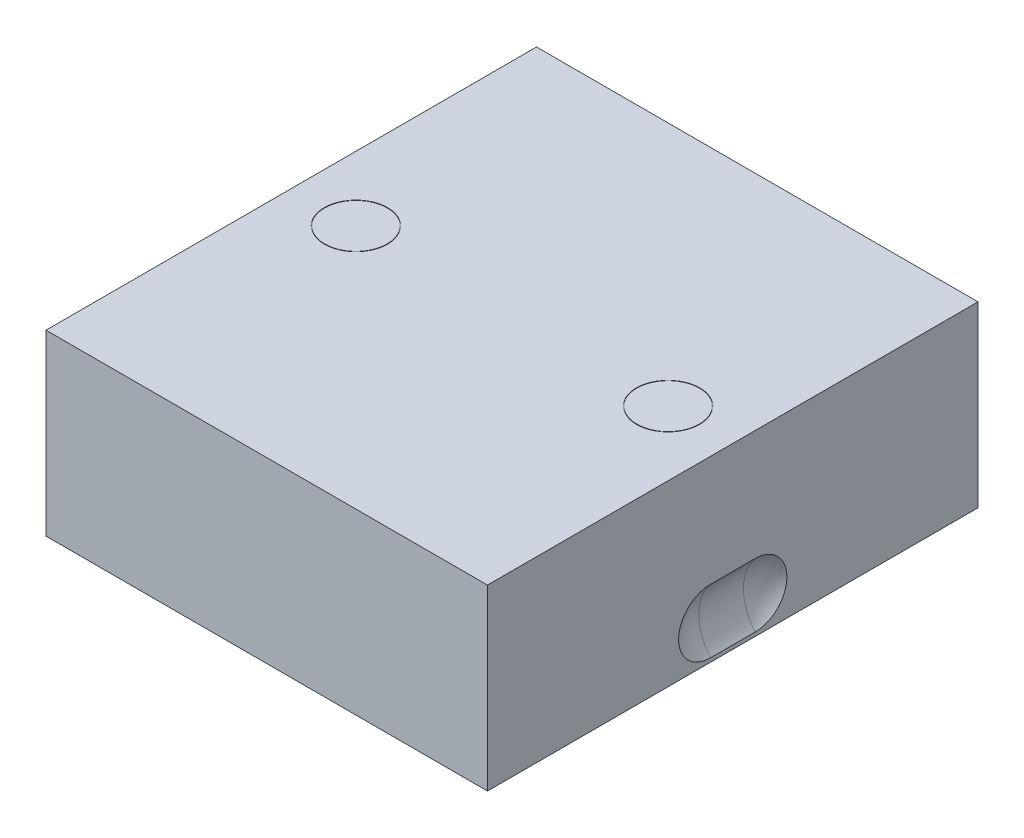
ISO-10303-21;
HEADER;
FILE_DESCRIPTION(('STEP AP214'),'2;1');
FILE_NAME('part.step','',(''),(''),'','','');
FILE_SCHEMA(('AUTOMOTIVE_DESIGN { 1 0 10303 214 1 1 1 1 }'));
ENDSEC;
DATA;
#1=APPLICATION_CONTEXT('core data for automotive mechanical design processes');
#2=APPLICATION_PROTOCOL_DEFINITION('international standard','automotive_design',2000,#1);
#3=PRODUCT_CONTEXT('',#1,'mechanical');
#4=PRODUCT('Part','Part','',(#3));
#5=PRODUCT_RELATED_PRODUCT_CATEGORY('part','',(#4));
#6=PRODUCT_DEFINITION_FORMATION('','',#4);
#7=PRODUCT_DEFINITION_CONTEXT('part definition',#1,'design');
#8=PRODUCT_DEFINITION('design','',#6,#7);
#9=PRODUCT_DEFINITION_SHAPE('','',#8);
#10=(LENGTH_UNIT() NAMED_UNIT(*) SI_UNIT(.MILLI.,.METRE.));
#11=(NAMED_UNIT(*) PLANE_ANGLE_UNIT() SI_UNIT($,.RADIAN.));
#12=(NAMED_UNIT(*) SI_UNIT($,.STERADIAN.) SOLID_ANGLE_UNIT());
#13=UNCERTAINTY_MEASURE_WITH_UNIT(LENGTH_MEASURE(1.E-05),#10,'distance_accuracy_value','');
#14=(GEOMETRIC_REPRESENTATION_CONTEXT(3) GLOBAL_UNCERTAINTY_ASSIGNED_CONTEXT((#13)) GLOBAL_UNIT_ASSIGNED_CONTEXT((#10,
#11,#12)) REPRESENTATION_CONTEXT('',''));
#15=CARTESIAN_POINT('',(0.,0.,0.));
#16=DIRECTION('',(0.,0.,1.));
#17=DIRECTION('',(1.,0.,0.));
#18=AXIS2_PLACEMENT_3D('',#15,#16,#17);
#19=CARTESIAN_POINT('',(35.,91.5,0.));
#20=DIRECTION('',(0.,1.,0.));
#21=DIRECTION('',(0.,0.,1.));
#22=AXIS2_PLACEMENT_3D('',#19,#20,#21);
#23=PLANE('',#22);
#24=CARTESIAN_POINT('',(35.,91.5,0.));
#25=DIRECTION('',(0.,-1.,0.));
#26=DIRECTION('',(0.,0.,-1.));
#27=AXIS2_PLACEMENT_3D('',#24,#25,#26);
#28=CIRCLE('',#27,7.);
#29=CARTESIAN_POINT('',(35.,91.5,-7.));
#30=VERTEX_POINT('',#29);
#31=EDGE_CURVE('E9',#30,#30,#28,.F.);
#32=ORIENTED_EDGE('',*,*,#31,.F.);
#33=EDGE_LOOP('',(#32));
#34=FACE_BOUND('',#33,.T.);
#35=ADVANCED_FACE('F14',(#34),#23,.F.);
#36=CARTESIAN_POINT('',(35.,95.,0.));
#37=DIRECTION('',(0.,1.,0.));
#38=DIRECTION('',(0.,0.,1.));
#39=AXIS2_PLACEMENT_3D('',#36,#37,#38);
#40=PLANE('',#39);
#41=CARTESIAN_POINT('',(35.,95.,0.));
#42=DIRECTION('',(0.,1.,0.));
#43=DIRECTION('',(0.,0.,1.));
#44=AXIS2_PLACEMENT_3D('',#41,#42,#43);
#45=CIRCLE('',#44,7.1);
#46=CARTESIAN_POINT('',(35.,95.,7.1));
#47=VERTEX_POINT('',#46);
#48=EDGE_CURVE('E344',#47,#47,#45,.T.);
#49=ORIENTED_EDGE('',*,*,#48,.F.);
#50=EDGE_LOOP('',(#49));
#51=FACE_BOUND('',#50,.T.);
#52=CARTESIAN_POINT('',(-35.,95.,0.));
#53=DIRECTION('',(0.,1.,0.));
#54=DIRECTION('',(0.,0.,1.));
#55=AXIS2_PLACEMENT_3D('',#52,#53,#54);
#56=CIRCLE('',#55,7.1);
#57=CARTESIAN_POINT('',(-35.,95.,7.1));
#58=VERTEX_POINT('',#57);
#59=EDGE_CURVE('E330',#58,#58,#56,.T.);
#60=ORIENTED_EDGE('',*,*,#59,.F.);
#61=EDGE_LOOP('',(#60));
#62=FACE_BOUND('',#61,.T.);
#63=DIRECTION('',(0.,0.,-1.));
#64=VECTOR('',#63,1.);
#65=CARTESIAN_POINT('',(49.5,95.,-55.));
#66=LINE('',#65,#64);
#67=CARTESIAN_POINT('',(49.5,95.,-55.));
#68=VERTEX_POINT('',#67);
#69=CARTESIAN_POINT('',(49.5,95.,55.));
#70=VERTEX_POINT('',#69);
#71=EDGE_CURVE('E92',#68,#70,#66,.F.);
#72=ORIENTED_EDGE('',*,*,#71,.F.);
#73=DIRECTION('',(-1.,0.,0.));
#74=VECTOR('',#73,1.);
#75=CARTESIAN_POINT('',(-49.5,95.,-55.));
#76=LINE('',#75,#74);
#77=CARTESIAN_POINT('',(-49.5,95.,-55.));
#78=VERTEX_POINT('',#77);
#79=EDGE_CURVE('E102',#78,#68,#76,.F.);
#80=ORIENTED_EDGE('',*,*,#79,.F.);
#81=DIRECTION('',(0.,0.,1.));
#82=VECTOR('',#81,1.);
#83=CARTESIAN_POINT('',(-49.5,95.,55.));
#84=LINE('',#83,#82);
#85=CARTESIAN_POINT('',(-49.5,95.,55.));
#86=VERTEX_POINT('',#85);
#87=EDGE_CURVE('E108',#86,#78,#84,.F.);
#88=ORIENTED_EDGE('',*,*,#87,.F.);
#89=DIRECTION('',(1.,0.,0.));
#90=VECTOR('',#89,1.);
#91=CARTESIAN_POINT('',(49.5,95.,55.));
#92=LINE('',#91,#90);
#93=EDGE_CURVE('E107',#70,#86,#92,.F.);
#94=ORIENTED_EDGE('',*,*,#93,.F.);
#95=EDGE_LOOP('',(#72,#80,#88,#94));
#96=FACE_BOUND('',#95,.T.);
#97=ADVANCED_FACE('F175',(#51,#62,#96),#40,.T.);
#98=CARTESIAN_POINT('',(-35.,91.5,0.));
#99=DIRECTION('',(0.,1.,0.));
#100=DIRECTION('',(0.,0.,1.));
#101=AXIS2_PLACEMENT_3D('',#98,#99,#100);
#102=PLANE('',#101);
#103=CARTESIAN_POINT('',(-35.,91.5,0.));
#104=DIRECTION('',(0.,1.,0.));
#105=DIRECTION('',(0.,0.,1.));
#106=AXIS2_PLACEMENT_3D('',#103,#104,#105);
#107=CIRCLE('',#106,7.);
#108=CARTESIAN_POINT('',(-35.,91.5,7.));
#109=VERTEX_POINT('',#108);
#110=EDGE_CURVE('E23',#109,#109,#107,.T.);
#111=ORIENTED_EDGE('',*,*,#110,.F.);
#112=EDGE_LOOP('',(#111));
#113=FACE_BOUND('',#112,.T.);
#114=ADVANCED_FACE('F172',(#113),#102,.F.);
#115=CARTESIAN_POINT('',(-35.,77.25,0.));
#116=DIRECTION('',(0.,1.,0.));
#117=DIRECTION('',(0.,0.,1.));
#118=AXIS2_PLACEMENT_3D('',#115,#116,#117);
#119=CYLINDRICAL_SURFACE('',#118,7.);
#120=ORIENTED_EDGE('',*,*,#110,.T.);
#121=EDGE_LOOP('',(#120));
#122=FACE_BOUND('',#121,.T.);
#123=CARTESIAN_POINT('',(-35.,63.,0.));
#124=DIRECTION('',(0.,1.,0.));
#125=DIRECTION('',(0.,0.,1.));
#126=AXIS2_PLACEMENT_3D('',#123,#124,#125);
#127=CIRCLE('',#126,7.);
#128=CARTESIAN_POINT('',(-35.,63.,7.));
#129=VERTEX_POINT('',#128);
#130=EDGE_CURVE('E17',#129,#129,#127,.F.);
#131=ORIENTED_EDGE('',*,*,#130,.T.);
#132=EDGE_LOOP('',(#131));
#133=FACE_BOUND('',#132,.T.);
#134=ADVANCED_FACE('F174',(#122,#133),#119,.F.);
#135=CARTESIAN_POINT('',(-40.6,63.,0.));
#136=DIRECTION('',(0.,-1.,0.));
#137=DIRECTION('',(0.,0.,-1.));
#138=AXIS2_PLACEMENT_3D('',#135,#136,#137);
#139=PLANE('',#138);
#140=CARTESIAN_POINT('',(-35.,63.,0.));
#141=DIRECTION('',(0.,1.,0.));
#142=DIRECTION('',(0.,0.,1.));
#143=AXIS2_PLACEMENT_3D('',#140,#141,#142);
#144=CIRCLE('',#143,4.2);
#145=CARTESIAN_POINT('',(-35.,63.,4.2));
#146=VERTEX_POINT('',#145);
#147=EDGE_CURVE('E319',#146,#146,#144,.F.);
#148=ORIENTED_EDGE('',*,*,#147,.T.);
#149=EDGE_LOOP('',(#148));
#150=FACE_BOUND('',#149,.T.);
#151=ORIENTED_EDGE('',*,*,#130,.F.);
#152=EDGE_LOOP('',(#151));
#153=FACE_BOUND('',#152,.T.);
#154=ADVANCED_FACE('F216',(#150,#153),#139,.F.);
#155=CARTESIAN_POINT('',(-35.,56.45,0.));
#156=DIRECTION('',(0.,1.,0.));
#157=DIRECTION('',(0.,0.,1.));
#158=AXIS2_PLACEMENT_3D('',#155,#156,#157);
#159=CYLINDRICAL_SURFACE('',#158,4.2);
#160=ORIENTED_EDGE('',*,*,#147,.F.);
#161=EDGE_LOOP('',(#160));
#162=FACE_BOUND('',#161,.T.);
#163=CARTESIAN_POINT('',(-35.,50.,0.));
#164=DIRECTION('',(0.,1.,0.));
#165=DIRECTION('',(0.,0.,1.));
#166=AXIS2_PLACEMENT_3D('',#163,#164,#165);
#167=CIRCLE('',#166,4.2);
#168=CARTESIAN_POINT('',(-35.,50.,4.2));
#169=VERTEX_POINT('',#168);
#170=EDGE_CURVE('E313',#169,#169,#167,.T.);
#171=ORIENTED_EDGE('',*,*,#170,.F.);
#172=EDGE_LOOP('',(#171));
#173=FACE_BOUND('',#172,.T.);
#174=ADVANCED_FACE('F225',(#162,#173),#159,.F.);
#175=CARTESIAN_POINT('',(-38.5,50.,0.));
#176=DIRECTION('',(0.,-1.,0.));
#177=DIRECTION('',(0.,0.,-1.));
#178=AXIS2_PLACEMENT_3D('',#175,#176,#177);
#179=PLANE('',#178);
#180=CARTESIAN_POINT('',(-35.,50.,0.));
#181=DIRECTION('',(0.,1.,0.));
#182=DIRECTION('',(0.,0.,1.));
#183=AXIS2_PLACEMENT_3D('',#180,#181,#182);
#184=CIRCLE('',#183,7.);
#185=CARTESIAN_POINT('',(-35.,50.,7.));
#186=VERTEX_POINT('',#185);
#187=EDGE_CURVE('E301',#186,#186,#184,.T.);
#188=ORIENTED_EDGE('',*,*,#187,.F.);
#189=EDGE_LOOP('',(#188));
#190=FACE_BOUND('',#189,.T.);
#191=ORIENTED_EDGE('',*,*,#170,.T.);
#192=EDGE_LOOP('',(#191));
#193=FACE_BOUND('',#192,.T.);
#194=ADVANCED_FACE('F233',(#190,#193),#179,.T.);
#195=CARTESIAN_POINT('',(-35.,52.5,0.));
#196=DIRECTION('',(0.,1.,0.));
#197=DIRECTION('',(0.,0.,1.));
#198=AXIS2_PLACEMENT_3D('',#195,#196,#197);
#199=CYLINDRICAL_SURFACE('',#198,7.);
#200=ORIENTED_EDGE('',*,*,#187,.T.);
#201=EDGE_LOOP('',(#200));
#202=FACE_BOUND('',#201,.T.);
#203=CARTESIAN_POINT('',(-35.,55.,0.));
#204=DIRECTION('',(0.,1.,0.));
#205=DIRECTION('',(0.,0.,1.));
#206=AXIS2_PLACEMENT_3D('',#203,#204,#205);
#207=CIRCLE('',#206,7.);
#208=CARTESIAN_POINT('',(-35.,55.,7.));
#209=VERTEX_POINT('',#208);
#210=EDGE_CURVE('E120',#209,#209,#207,.F.);
#211=ORIENTED_EDGE('',*,*,#210,.T.);
#212=EDGE_LOOP('',(#211));
#213=FACE_BOUND('',#212,.T.);
#214=ADVANCED_FACE('F241',(#202,#213),#199,.T.);
#215=CARTESIAN_POINT('',(38.5,50.,0.));
#216=DIRECTION('',(0.,-1.,0.));
#217=DIRECTION('',(0.,0.,-1.));
#218=AXIS2_PLACEMENT_3D('',#215,#216,#217);
#219=PLANE('',#218);
#220=CARTESIAN_POINT('',(35.,50.,0.));
#221=DIRECTION('',(0.,-1.,0.));
#222=DIRECTION('',(0.,0.,-1.));
#223=AXIS2_PLACEMENT_3D('',#220,#221,#222);
#224=CIRCLE('',#223,7.);
#225=CARTESIAN_POINT('',(35.,50.,-7.));
#226=VERTEX_POINT('',#225);
#227=EDGE_CURVE('E98',#226,#226,#224,.F.);
#228=ORIENTED_EDGE('',*,*,#227,.F.);
#229=EDGE_LOOP('',(#228));
#230=FACE_BOUND('',#229,.T.);
#231=CARTESIAN_POINT('',(35.,50.,0.));
#232=DIRECTION('',(0.,-1.,0.));
#233=DIRECTION('',(0.,0.,-1.));
#234=AXIS2_PLACEMENT_3D('',#231,#232,#233);
#235=CIRCLE('',#234,4.2);
#236=CARTESIAN_POINT('',(35.,50.,-4.2));
#237=VERTEX_POINT('',#236);
#238=EDGE_CURVE('E86',#237,#237,#235,.F.);
#239=ORIENTED_EDGE('',*,*,#238,.T.);
#240=EDGE_LOOP('',(#239));
#241=FACE_BOUND('',#240,.T.);
#242=ADVANCED_FACE('F237',(#230,#241),#219,.T.);
#243=CARTESIAN_POINT('',(35.,56.45,0.));
#244=DIRECTION('',(0.,-1.,0.));
#245=DIRECTION('',(0.,0.,-1.));
#246=AXIS2_PLACEMENT_3D('',#243,#244,#245);
#247=CYLINDRICAL_SURFACE('',#246,4.2);
#248=CARTESIAN_POINT('',(35.,63.,0.));
#249=DIRECTION('',(0.,-1.,0.));
#250=DIRECTION('',(0.,0.,-1.));
#251=AXIS2_PLACEMENT_3D('',#248,#249,#250);
#252=CIRCLE('',#251,4.2);
#253=CARTESIAN_POINT('',(35.,63.,-4.2));
#254=VERTEX_POINT('',#253);
#255=EDGE_CURVE('E316',#254,#254,#252,.T.);
#256=ORIENTED_EDGE('',*,*,#255,.F.);
#257=EDGE_LOOP('',(#256));
#258=FACE_BOUND('',#257,.T.);
#259=ORIENTED_EDGE('',*,*,#238,.F.);
#260=EDGE_LOOP('',(#259));
#261=FACE_BOUND('',#260,.T.);
#262=ADVANCED_FACE('F229',(#258,#261),#247,.F.);
#263=CARTESIAN_POINT('',(40.6,63.,0.));
#264=DIRECTION('',(0.,-1.,0.));
#265=DIRECTION('',(0.,0.,-1.));
#266=AXIS2_PLACEMENT_3D('',#263,#264,#265);
#267=PLANE('',#266);
#268=CARTESIAN_POINT('',(35.,63.,0.));
#269=DIRECTION('',(0.,-1.,0.));
#270=DIRECTION('',(0.,0.,-1.));
#271=AXIS2_PLACEMENT_3D('',#268,#269,#270);
#272=CIRCLE('',#271,7.);
#273=CARTESIAN_POINT('',(35.,63.,-7.));
#274=VERTEX_POINT('',#273);
#275=EDGE_CURVE('E321',#274,#274,#272,.T.);
#276=ORIENTED_EDGE('',*,*,#275,.F.);
#277=EDGE_LOOP('',(#276));
#278=FACE_BOUND('',#277,.T.);
#279=ORIENTED_EDGE('',*,*,#255,.T.);
#280=EDGE_LOOP('',(#279));
#281=FACE_BOUND('',#280,.T.);
#282=ADVANCED_FACE('F221',(#278,#281),#267,.F.);
#283=CARTESIAN_POINT('',(35.,77.25,0.));
#284=DIRECTION('',(0.,-1.,0.));
#285=DIRECTION('',(0.,0.,-1.));
#286=AXIS2_PLACEMENT_3D('',#283,#284,#285);
#287=CYLINDRICAL_SURFACE('',#286,7.);
#288=ORIENTED_EDGE('',*,*,#275,.T.);
#289=EDGE_LOOP('',(#288));
#290=FACE_BOUND('',#289,.T.);
#291=ORIENTED_EDGE('',*,*,#31,.T.);
#292=EDGE_LOOP('',(#291));
#293=FACE_BOUND('',#292,.T.);
#294=ADVANCED_FACE('F218',(#290,#293),#287,.F.);
#295=CARTESIAN_POINT('',(35.,52.5,0.));
#296=DIRECTION('',(0.,-1.,0.));
#297=DIRECTION('',(0.,0.,-1.));
#298=AXIS2_PLACEMENT_3D('',#295,#296,#297);
#299=CYLINDRICAL_SURFACE('',#298,7.);
#300=ORIENTED_EDGE('',*,*,#227,.T.);
#301=EDGE_LOOP('',(#300));
#302=FACE_BOUND('',#301,.T.);
#303=CARTESIAN_POINT('',(35.,55.,0.));
#304=DIRECTION('',(0.,-1.,0.));
#305=DIRECTION('',(0.,0.,-1.));
#306=AXIS2_PLACEMENT_3D('',#303,#304,#305);
#307=CIRCLE('',#306,7.);
#308=CARTESIAN_POINT('',(35.,55.,-7.));
#309=VERTEX_POINT('',#308);
#310=EDGE_CURVE('E134',#309,#309,#307,.T.);
#311=ORIENTED_EDGE('',*,*,#310,.T.);
#312=EDGE_LOOP('',(#311));
#313=FACE_BOUND('',#312,.T.);
#314=ADVANCED_FACE('F209',(#302,#313),#299,.T.);
#315=CARTESIAN_POINT('',(-57.9999999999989,63.,-5.00000000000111));
#316=DIRECTION('',(0.233607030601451,0.079934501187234,0.96903984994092));
#317=DIRECTION('',(0.203762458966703,-0.978510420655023,0.0315945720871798));
#318=AXIS2_PLACEMENT_3D('',#315,#316,#317);
#319=SPHERICAL_SURFACE('',#318,11.1);
#320=CARTESIAN_POINT('',(-58.,63.,-5.));
#321=DIRECTION('',(0.,0.,1.));
#322=DIRECTION('',(1.,0.,0.));
#323=AXIS2_PLACEMENT_3D('',#320,#321,#322);
#324=CIRCLE('',#323,11.1);
#325=CARTESIAN_POINT('',(-49.5,55.8613726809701,-5.));
#326=VERTEX_POINT('',#325);
#327=CARTESIAN_POINT('',(-49.5,70.1386273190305,-5.));
#328=VERTEX_POINT('',#327);
#329=EDGE_CURVE('E302',#326,#328,#324,.T.);
#330=ORIENTED_EDGE('',*,*,#329,.T.);
#331=CARTESIAN_POINT('',(-49.5,55.8613726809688,-5.));
#332=CARTESIAN_POINT('',(-49.5,55.8613510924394,-5.2007761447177));
#333=CARTESIAN_POINT('',(-49.5,55.869842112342,-5.40154918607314));
#334=CARTESIAN_POINT('',(-49.5,55.9036934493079,-5.80165887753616));
#335=CARTESIAN_POINT('',(-49.5,55.9290529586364,-6.000995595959));
#336=CARTESIAN_POINT('',(-49.5,55.9964616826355,-6.3966828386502));
#337=CARTESIAN_POINT('',(-49.5,56.0384991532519,-6.59303536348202));
#338=CARTESIAN_POINT('',(-49.5,56.1389579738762,-6.98150076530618));
#339=CARTESIAN_POINT('',(-49.5,56.1973791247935,-7.17361369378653));
#340=CARTESIAN_POINT('',(-49.5,56.3302113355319,-7.55229163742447));
#341=CARTESIAN_POINT('',(-49.5,56.4046269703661,-7.73885504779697));
#342=CARTESIAN_POINT('',(-49.5,56.5689392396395,-8.10511814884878));
#343=CARTESIAN_POINT('',(-49.5,56.6588415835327,-8.28481527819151));
#344=CARTESIAN_POINT('',(-49.5,56.8534137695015,-8.63589520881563));
#345=CARTESIAN_POINT('',(-49.5,56.9580752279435,-8.80728265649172));
#346=CARTESIAN_POINT('',(-49.5,57.1815016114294,-9.1406958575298));
#347=CARTESIAN_POINT('',(-49.5,57.300271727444,-9.30271813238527));
#348=CARTESIAN_POINT('',(-49.5,57.5509964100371,-9.61612584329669));
#349=CARTESIAN_POINT('',(-49.5,57.6829463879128,-9.76751495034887));
#350=CARTESIAN_POINT('',(-49.5,57.9591786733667,-10.0586962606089));
#351=CARTESIAN_POINT('',(-49.5,58.1034655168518,-10.198484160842));
#352=CARTESIAN_POINT('',(-49.5,58.4032709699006,-10.4653776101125));
#353=CARTESIAN_POINT('',(-49.5,58.5587871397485,-10.5924858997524));
#354=CARTESIAN_POINT('',(-49.5,58.8800329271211,-10.8331956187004));
#355=CARTESIAN_POINT('',(-49.5,59.0457662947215,-10.9467920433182));
#356=CARTESIAN_POINT('',(-49.5,59.3861453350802,-11.1595715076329));
#357=CARTESIAN_POINT('',(-49.5,59.5607873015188,-11.2587604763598));
#358=CARTESIAN_POINT('',(-49.5,59.9178710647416,-11.4421097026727));
#359=CARTESIAN_POINT('',(-49.5,60.1003157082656,-11.5262644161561));
#360=CARTESIAN_POINT('',(-49.5,60.4715990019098,-11.6788819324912));
#361=CARTESIAN_POINT('',(-49.5,60.6604359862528,-11.7473487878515));
#362=CARTESIAN_POINT('',(-49.5,61.0432103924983,-11.8681330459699));
#363=CARTESIAN_POINT('',(-49.5,61.2371479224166,-11.9204501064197));
#364=CARTESIAN_POINT('',(-49.5,61.6287427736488,-12.008561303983));
#365=CARTESIAN_POINT('',(-49.5,61.8264001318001,-12.0443552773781));
#366=CARTESIAN_POINT('',(-49.5,62.2240275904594,-12.0991650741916));
#367=CARTESIAN_POINT('',(-49.5,62.423997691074,-12.118180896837));
#368=CARTESIAN_POINT('',(-49.5,62.8248357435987,-12.1392995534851));
#369=CARTESIAN_POINT('',(-49.5,63.0257037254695,-12.1414018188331));
#370=CARTESIAN_POINT('',(-49.5,63.4268984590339,-12.1286770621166));
#371=CARTESIAN_POINT('',(-49.5,63.6272252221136,-12.113850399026));
#372=CARTESIAN_POINT('',(-49.5,64.0259544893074,-12.0673694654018));
#373=CARTESIAN_POINT('',(-49.5,64.224356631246,-12.0357120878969));
#374=CARTESIAN_POINT('',(-49.5,64.6177155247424,-11.955807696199));
#375=CARTESIAN_POINT('',(-49.5,64.812673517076,-11.9075667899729));
#376=CARTESIAN_POINT('',(-49.5,65.1979040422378,-11.794815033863));
#377=CARTESIAN_POINT('',(-49.5,65.388174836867,-11.7302982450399));
#378=CARTESIAN_POINT('',(-49.5,65.7625345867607,-11.5854890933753));
#379=CARTESIAN_POINT('',(-49.5,65.9466257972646,-11.505202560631));
#380=CARTESIAN_POINT('',(-49.5,66.3074632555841,-11.329374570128));
#381=CARTESIAN_POINT('',(-49.5,66.4842065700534,-11.2338270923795));
#382=CARTESIAN_POINT('',(-49.5,66.8289501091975,-11.0282175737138));
#383=CARTESIAN_POINT('',(-49.5,66.9969535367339,-10.9181609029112));
#384=CARTESIAN_POINT('',(-49.5,67.323145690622,-10.6842504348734));
#385=CARTESIAN_POINT('',(-49.5,67.4813312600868,-10.5603922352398));
#386=CARTESIAN_POINT('',(-49.5,67.7866477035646,-10.2998363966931));
#387=CARTESIAN_POINT('',(-49.5,67.93378263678,-10.1631435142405));
#388=CARTESIAN_POINT('',(-49.5,68.2160483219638,-9.87781916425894));
#389=CARTESIAN_POINT('',(-49.5,68.3511763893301,-9.72918504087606));
#390=CARTESIAN_POINT('',(-49.5,68.6083861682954,-9.42111487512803));
#391=CARTESIAN_POINT('',(-49.5,68.7304723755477,-9.26168258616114));
#392=CARTESIAN_POINT('',(-49.5,68.9608430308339,-8.93301960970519));
#393=CARTESIAN_POINT('',(-49.5,69.0691204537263,-8.76378399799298));
#394=CARTESIAN_POINT('',(-49.5,69.2710278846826,-8.41679668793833));
#395=CARTESIAN_POINT('',(-49.5,69.3646583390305,-8.23904524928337));
#396=CARTESIAN_POINT('',(-49.5,69.5366646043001,-7.87617071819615));
#397=CARTESIAN_POINT('',(-49.5,69.6150306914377,-7.6910430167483));
#398=CARTESIAN_POINT('',(-49.5,69.7558746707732,-7.31484249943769));
#399=CARTESIAN_POINT('',(-49.5,69.8183529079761,-7.12376981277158));
#400=CARTESIAN_POINT('',(-49.5,69.9269086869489,-6.73729011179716));
#401=CARTESIAN_POINT('',(-49.5,69.9730070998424,-6.54188895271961));
#402=CARTESIAN_POINT('',(-49.5,70.0485699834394,-6.14797649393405));
#403=CARTESIAN_POINT('',(-49.5,70.0780426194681,-5.94946677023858));
#404=CARTESIAN_POINT('',(-49.5,70.112281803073,-5.62543751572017));
#405=CARTESIAN_POINT('',(-49.5,70.1221676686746,-5.50043666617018));
#406=CARTESIAN_POINT('',(-49.5,70.1353356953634,-5.25029488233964));
#407=CARTESIAN_POINT('',(-49.5,70.138628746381,-5.12515452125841));
#408=CARTESIAN_POINT('',(-49.5,70.1386273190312,-5.));
#409=B_SPLINE_CURVE_WITH_KNOTS('',3,(#331,#332,#333,#334,#335,#336,#337,#338,#339,#340,#341,
#342,#343,#344,#345,#346,#347,#348,#349,#350,#351,#352,#353,#354,#355,#356,#357,#358,#359,#360,
#361,#362,#363,#364,#365,#366,#367,#368,#369,#370,#371,#372,#373,#374,#375,#376,#377,#378,#379,
#380,#381,#382,#383,#384,#385,#386,#387,#388,#389,#390,#391,#392,#393,#394,#395,#396,#397,#398,
#399,#400,#401,#402,#403,#404,#405,#406,#407,#408),.UNSPECIFIED.,.F.,.F.,(4,2,2,2,2,2,2,2,2,2,2,
2,2,2,2,2,2,2,2,2,2,2,2,2,2,2,2,2,2,2,2,2,2,2,2,2,2,2,4),(0.,0.602144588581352,1.20426034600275,
1.80595286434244,2.40763807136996,3.00949561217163,3.61157551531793,4.21331478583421,
4.81527614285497,5.4170286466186,6.01900335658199,6.62084767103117,7.22291421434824,
7.82473228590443,8.42677183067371,9.0286556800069,9.63055228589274,10.2324548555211,
10.8343574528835,11.4362802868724,12.0381903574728,12.6402115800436,13.2420113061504,
13.8440309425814,14.4458284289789,15.0478638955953,15.6496771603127,16.2516829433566,
16.8534665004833,17.4553842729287,18.0570938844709,18.6591084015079,19.2611045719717,
19.8634829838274,20.4658483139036,21.0674433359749,21.6687426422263,22.0447563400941,
22.4201484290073),.UNSPECIFIED.);
#410=EDGE_CURVE('E114',#326,#328,#409,.T.);
#411=ORIENTED_EDGE('',*,*,#410,.F.);
#412=EDGE_LOOP('',(#330,#411));
#413=FACE_BOUND('',#412,.T.);
#414=ADVANCED_FACE('F264',(#413),#319,.F.);
#415=CARTESIAN_POINT('',(-57.9999999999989,63.,5.00000000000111));
#416=DIRECTION('',(0.233607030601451,0.079934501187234,0.96903984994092));
#417=DIRECTION('',(0.203762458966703,-0.978510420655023,0.0315945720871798));
#418=AXIS2_PLACEMENT_3D('',#415,#416,#417);
#419=SPHERICAL_SURFACE('',#418,11.1);
#420=CARTESIAN_POINT('',(-58.,63.,5.));
#421=DIRECTION('',(0.,0.,1.));
#422=DIRECTION('',(1.,0.,0.));
#423=AXIS2_PLACEMENT_3D('',#420,#421,#422);
#424=CIRCLE('',#423,11.1);
#425=CARTESIAN_POINT('',(-49.5,55.8613726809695,5.));
#426=VERTEX_POINT('',#425);
#427=CARTESIAN_POINT('',(-49.5,70.1386273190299,5.));
#428=VERTEX_POINT('',#427);
#429=EDGE_CURVE('E298',#426,#428,#424,.T.);
#430=ORIENTED_EDGE('',*,*,#429,.F.);
#431=CARTESIAN_POINT('',(-49.5,70.1386273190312,5.));
#432=CARTESIAN_POINT('',(-49.5,70.1386489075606,5.20077614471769));
#433=CARTESIAN_POINT('',(-49.5,70.130157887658,5.40154918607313));
#434=CARTESIAN_POINT('',(-49.5,70.0963065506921,5.80165887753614));
#435=CARTESIAN_POINT('',(-49.5,70.0709470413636,6.00099559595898));
#436=CARTESIAN_POINT('',(-49.5,70.0035383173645,6.39668283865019));
#437=CARTESIAN_POINT('',(-49.5,69.9615008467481,6.593035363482));
#438=CARTESIAN_POINT('',(-49.5,69.8610420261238,6.98150076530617));
#439=CARTESIAN_POINT('',(-49.5,69.8026208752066,7.17361369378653));
#440=CARTESIAN_POINT('',(-49.5,69.6697886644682,7.55229163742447));
#441=CARTESIAN_POINT('',(-49.5,69.595373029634,7.73885504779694));
#442=CARTESIAN_POINT('',(-49.5,69.4310607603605,8.10511814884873));
#443=CARTESIAN_POINT('',(-49.5,69.3411584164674,8.28481527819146));
#444=CARTESIAN_POINT('',(-49.5,69.1465862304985,8.63589520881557));
#445=CARTESIAN_POINT('',(-49.5,69.0419247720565,8.80728265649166));
#446=CARTESIAN_POINT('',(-49.5,68.8184983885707,9.14069585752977));
#447=CARTESIAN_POINT('',(-49.5,68.6997282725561,9.30271813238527));
#448=CARTESIAN_POINT('',(-49.5,68.449003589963,9.61612584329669));
#449=CARTESIAN_POINT('',(-49.5,68.3170536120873,9.76751495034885));
#450=CARTESIAN_POINT('',(-49.5,68.0408213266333,10.0586962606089));
#451=CARTESIAN_POINT('',(-49.5,67.8965344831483,10.198484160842));
#452=CARTESIAN_POINT('',(-49.5,67.5967290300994,10.4653776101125));
#453=CARTESIAN_POINT('',(-49.5,67.4412128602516,10.5924858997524));
#454=CARTESIAN_POINT('',(-49.5,67.1199670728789,10.8331956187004));
#455=CARTESIAN_POINT('',(-49.5,66.9542337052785,10.9467920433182));
#456=CARTESIAN_POINT('',(-49.5,66.6138546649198,11.159571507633));
#457=CARTESIAN_POINT('',(-49.5,66.4392126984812,11.2587604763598));
#458=CARTESIAN_POINT('',(-49.5,66.0821289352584,11.4421097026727));
#459=CARTESIAN_POINT('',(-49.5,65.8996842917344,11.5262644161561));
#460=CARTESIAN_POINT('',(-49.5,65.5284009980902,11.6788819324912));
#461=CARTESIAN_POINT('',(-49.5,65.3395640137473,11.7473487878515));
#462=CARTESIAN_POINT('',(-49.5,64.9567896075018,11.8681330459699));
#463=CARTESIAN_POINT('',(-49.5,64.7628520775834,11.9204501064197));
#464=CARTESIAN_POINT('',(-49.5,64.3712572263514,12.008561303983));
#465=CARTESIAN_POINT('',(-49.5,64.1735998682,12.0443552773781));
#466=CARTESIAN_POINT('',(-49.5,63.7759724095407,12.0991650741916));
#467=CARTESIAN_POINT('',(-49.5,63.5760023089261,12.118180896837));
#468=CARTESIAN_POINT('',(-49.5,63.1751642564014,12.1392995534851));
#469=CARTESIAN_POINT('',(-49.5,62.9742962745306,12.1414018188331));
#470=CARTESIAN_POINT('',(-49.5,62.5731015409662,12.1286770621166));
#471=CARTESIAN_POINT('',(-49.5,62.3727747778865,12.113850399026));
#472=CARTESIAN_POINT('',(-49.5,61.9740455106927,12.0673694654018));
#473=CARTESIAN_POINT('',(-49.5,61.7756433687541,12.0357120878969));
#474=CARTESIAN_POINT('',(-49.5,61.3822844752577,11.955807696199));
#475=CARTESIAN_POINT('',(-49.5,61.1873264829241,11.9075667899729));
#476=CARTESIAN_POINT('',(-49.5,60.8020959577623,11.794815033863));
#477=CARTESIAN_POINT('',(-49.5,60.6118251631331,11.7302982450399));
#478=CARTESIAN_POINT('',(-49.5,60.2374654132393,11.5854890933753));
#479=CARTESIAN_POINT('',(-49.5,60.0533742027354,11.505202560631));
#480=CARTESIAN_POINT('',(-49.5,59.6925367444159,11.329374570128));
#481=CARTESIAN_POINT('',(-49.5,59.5157934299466,11.2338270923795));
#482=CARTESIAN_POINT('',(-49.5,59.1710498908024,11.0282175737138));
#483=CARTESIAN_POINT('',(-49.5,59.0030464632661,10.9181609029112));
#484=CARTESIAN_POINT('',(-49.5,58.676854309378,10.6842504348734));
#485=CARTESIAN_POINT('',(-49.5,58.5186687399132,10.5603922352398));
#486=CARTESIAN_POINT('',(-49.5,58.2133522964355,10.2998363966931));
#487=CARTESIAN_POINT('',(-49.5,58.06621736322,10.1631435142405));
#488=CARTESIAN_POINT('',(-49.5,57.7839516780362,9.87781916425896));
#489=CARTESIAN_POINT('',(-49.5,57.6488236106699,9.72918504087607));
#490=CARTESIAN_POINT('',(-49.5,57.3916138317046,9.42111487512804));
#491=CARTESIAN_POINT('',(-49.5,57.2695276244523,9.26168258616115));
#492=CARTESIAN_POINT('',(-49.5,57.0391569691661,8.93301960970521));
#493=CARTESIAN_POINT('',(-49.5,56.9308795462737,8.76378399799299));
#494=CARTESIAN_POINT('',(-49.5,56.7289721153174,8.41679668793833));
#495=CARTESIAN_POINT('',(-49.5,56.6353416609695,8.23904524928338));
#496=CARTESIAN_POINT('',(-49.5,56.4633353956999,7.87617071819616));
#497=CARTESIAN_POINT('',(-49.5,56.3849693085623,7.6910430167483));
#498=CARTESIAN_POINT('',(-49.5,56.2441253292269,7.3148424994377));
#499=CARTESIAN_POINT('',(-49.5,56.1816470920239,7.12376981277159));
#500=CARTESIAN_POINT('',(-49.5,56.0730913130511,6.73729011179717));
#501=CARTESIAN_POINT('',(-49.5,56.0269929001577,6.54188895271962));
#502=CARTESIAN_POINT('',(-49.5,55.9514300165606,6.14797649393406));
#503=CARTESIAN_POINT('',(-49.5,55.9219573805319,5.94946677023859));
#504=CARTESIAN_POINT('',(-49.5,55.887718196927,5.62543751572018));
#505=CARTESIAN_POINT('',(-49.5,55.8778323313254,5.50043666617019));
#506=CARTESIAN_POINT('',(-49.5,55.8646643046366,5.25029488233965));
#507=CARTESIAN_POINT('',(-49.5,55.861371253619,5.12515452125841));
#508=CARTESIAN_POINT('',(-49.5,55.8613726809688,5.));
#509=B_SPLINE_CURVE_WITH_KNOTS('',3,(#431,#432,#433,#434,#435,#436,#437,#438,#439,#440,#441,
#442,#443,#444,#445,#446,#447,#448,#449,#450,#451,#452,#453,#454,#455,#456,#457,#458,#459,#460,
#461,#462,#463,#464,#465,#466,#467,#468,#469,#470,#471,#472,#473,#474,#475,#476,#477,#478,#479,
#480,#481,#482,#483,#484,#485,#486,#487,#488,#489,#490,#491,#492,#493,#494,#495,#496,#497,#498,
#499,#500,#501,#502,#503,#504,#505,#506,#507,#508),.UNSPECIFIED.,.F.,.F.,(4,2,2,2,2,2,2,2,2,2,2,
2,2,2,2,2,2,2,2,2,2,2,2,2,2,2,2,2,2,2,2,2,2,2,2,2,2,2,4),(0.,0.602144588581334,1.20426034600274,
1.80595286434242,2.40763807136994,3.00949561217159,3.61157551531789,4.21331478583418,
4.81527614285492,5.41702864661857,6.01900335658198,6.62084767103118,7.22291421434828,
7.82473228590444,8.42677183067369,9.02865568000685,9.63055228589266,10.232454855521,
10.8343574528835,11.4362802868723,12.0381903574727,12.6402115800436,13.2420113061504,
13.8440309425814,14.4458284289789,15.0478638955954,15.6496771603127,16.2516829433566,
16.8534665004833,17.4553842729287,18.0570938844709,18.6591084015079,19.2611045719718,
19.8634829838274,20.4658483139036,21.0674433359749,21.6687426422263,22.0447563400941,
22.4201484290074),.UNSPECIFIED.);
#510=EDGE_CURVE('E111',#428,#426,#509,.T.);
#511=ORIENTED_EDGE('',*,*,#510,.F.);
#512=EDGE_LOOP('',(#430,#511));
#513=FACE_BOUND('',#512,.T.);
#514=ADVANCED_FACE('F152',(#513),#419,.F.);
#515=CARTESIAN_POINT('',(-58.,63.,0.));
#516=DIRECTION('',(0.,0.,1.));
#517=DIRECTION('',(1.,0.,0.));
#518=AXIS2_PLACEMENT_3D('',#515,#516,#517);
#519=CYLINDRICAL_SURFACE('',#518,11.1);
#520=ORIENTED_EDGE('',*,*,#329,.F.);
#521=DIRECTION('',(0.,0.,1.));
#522=VECTOR('',#521,1.);
#523=CARTESIAN_POINT('',(-49.5,55.8613726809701,55.));
#524=LINE('',#523,#522);
#525=EDGE_CURVE('E101',#426,#326,#524,.F.);
#526=ORIENTED_EDGE('',*,*,#525,.F.);
#527=ORIENTED_EDGE('',*,*,#429,.T.);
#528=DIRECTION('',(0.,0.,1.));
#529=VECTOR('',#528,1.);
#530=CARTESIAN_POINT('',(-49.5,70.1386273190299,55.));
#531=LINE('',#530,#529);
#532=EDGE_CURVE('E112',#328,#428,#531,.T.);
#533=ORIENTED_EDGE('',*,*,#532,.F.);
#534=EDGE_LOOP('',(#520,#526,#527,#533));
#535=FACE_BOUND('',#534,.T.);
#536=ADVANCED_FACE('F251',(#535),#519,.F.);
#537=CARTESIAN_POINT('',(57.9999999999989,63.,5.00000000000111));
#538=DIRECTION('',(0.233607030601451,0.079934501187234,0.96903984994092));
#539=DIRECTION('',(0.203762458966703,-0.978510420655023,0.0315945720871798));
#540=AXIS2_PLACEMENT_3D('',#537,#538,#539);
#541=SPHERICAL_SURFACE('',#540,11.1);
#542=CARTESIAN_POINT('',(58.,63.,5.));
#543=DIRECTION('',(0.,0.,-1.));
#544=DIRECTION('',(-1.,0.,0.));
#545=AXIS2_PLACEMENT_3D('',#542,#543,#544);
#546=CIRCLE('',#545,11.1);
#547=CARTESIAN_POINT('',(49.5,55.8613726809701,5.));
#548=VERTEX_POINT('',#547);
#549=CARTESIAN_POINT('',(49.5,70.1386273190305,5.));
#550=VERTEX_POINT('',#549);
#551=EDGE_CURVE('E71',#548,#550,#546,.T.);
#552=ORIENTED_EDGE('',*,*,#551,.T.);
#553=CARTESIAN_POINT('',(49.5,55.8613726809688,5.));
#554=CARTESIAN_POINT('',(49.5,55.8613510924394,5.20077614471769));
#555=CARTESIAN_POINT('',(49.5,55.869842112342,5.40154918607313));
#556=CARTESIAN_POINT('',(49.5,55.9036934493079,5.80165887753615));
#557=CARTESIAN_POINT('',(49.5,55.9290529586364,6.000995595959));
#558=CARTESIAN_POINT('',(49.5,55.9964616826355,6.3966828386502));
#559=CARTESIAN_POINT('',(49.5,56.0384991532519,6.593035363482));
#560=CARTESIAN_POINT('',(49.5,56.1389579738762,6.98150076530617));
#561=CARTESIAN_POINT('',(49.5,56.1973791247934,7.17361369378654));
#562=CARTESIAN_POINT('',(49.5,56.3302113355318,7.55229163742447));
#563=CARTESIAN_POINT('',(49.5,56.404626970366,7.73885504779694));
#564=CARTESIAN_POINT('',(49.5,56.5689392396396,8.10511814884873));
#565=CARTESIAN_POINT('',(49.5,56.6588415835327,8.28481527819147));
#566=CARTESIAN_POINT('',(49.5,56.8534137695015,8.6358952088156));
#567=CARTESIAN_POINT('',(49.5,56.9580752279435,8.8072826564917));
#568=CARTESIAN_POINT('',(49.5,57.1815016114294,9.14069585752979));
#569=CARTESIAN_POINT('',(49.5,57.300271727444,9.30271813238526));
#570=CARTESIAN_POINT('',(49.5,57.5509964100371,9.61612584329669));
#571=CARTESIAN_POINT('',(49.5,57.6829463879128,9.76751495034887));
#572=CARTESIAN_POINT('',(49.5,57.9591786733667,10.0586962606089));
#573=CARTESIAN_POINT('',(49.5,58.1034655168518,10.198484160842));
#574=CARTESIAN_POINT('',(49.5,58.4032709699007,10.4653776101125));
#575=CARTESIAN_POINT('',(49.5,58.5587871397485,10.5924858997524));
#576=CARTESIAN_POINT('',(49.5,58.8800329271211,10.8331956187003));
#577=CARTESIAN_POINT('',(49.5,59.0457662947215,10.9467920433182));
#578=CARTESIAN_POINT('',(49.5,59.3861453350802,11.1595715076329));
#579=CARTESIAN_POINT('',(49.5,59.5607873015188,11.2587604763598));
#580=CARTESIAN_POINT('',(49.5,59.9178710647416,11.4421097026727));
#581=CARTESIAN_POINT('',(49.5,60.1003157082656,11.5262644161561));
#582=CARTESIAN_POINT('',(49.5,60.4715990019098,11.6788819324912));
#583=CARTESIAN_POINT('',(49.5,60.6604359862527,11.7473487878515));
#584=CARTESIAN_POINT('',(49.5,61.0432103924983,11.8681330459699));
#585=CARTESIAN_POINT('',(49.5,61.2371479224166,11.9204501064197));
#586=CARTESIAN_POINT('',(49.5,61.6287427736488,12.008561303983));
#587=CARTESIAN_POINT('',(49.5,61.8264001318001,12.0443552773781));
#588=CARTESIAN_POINT('',(49.5,62.2240275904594,12.0991650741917));
#589=CARTESIAN_POINT('',(49.5,62.423997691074,12.118180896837));
#590=CARTESIAN_POINT('',(49.5,62.8248357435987,12.1392995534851));
#591=CARTESIAN_POINT('',(49.5,63.0257037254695,12.1414018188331));
#592=CARTESIAN_POINT('',(49.5,63.4268984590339,12.1286770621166));
#593=CARTESIAN_POINT('',(49.5,63.6272252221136,12.113850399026));
#594=CARTESIAN_POINT('',(49.5,64.0259544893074,12.0673694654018));
#595=CARTESIAN_POINT('',(49.5,64.224356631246,12.0357120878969));
#596=CARTESIAN_POINT('',(49.5,64.6177155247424,11.955807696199));
#597=CARTESIAN_POINT('',(49.5,64.812673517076,11.9075667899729));
#598=CARTESIAN_POINT('',(49.5,65.1979040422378,11.794815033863));
#599=CARTESIAN_POINT('',(49.5,65.388174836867,11.7302982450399));
#600=CARTESIAN_POINT('',(49.5,65.7625345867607,11.5854890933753));
#601=CARTESIAN_POINT('',(49.5,65.9466257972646,11.505202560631));
#602=CARTESIAN_POINT('',(49.5,66.3074632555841,11.329374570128));
#603=CARTESIAN_POINT('',(49.5,66.4842065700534,11.2338270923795));
#604=CARTESIAN_POINT('',(49.5,66.8289501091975,11.0282175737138));
#605=CARTESIAN_POINT('',(49.5,66.9969535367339,10.9181609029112));
#606=CARTESIAN_POINT('',(49.5,67.323145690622,10.6842504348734));
#607=CARTESIAN_POINT('',(49.5,67.4813312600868,10.5603922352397));
#608=CARTESIAN_POINT('',(49.5,67.7866477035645,10.2998363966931));
#609=CARTESIAN_POINT('',(49.5,67.93378263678,10.1631435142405));
#610=CARTESIAN_POINT('',(49.5,68.2160483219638,9.87781916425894));
#611=CARTESIAN_POINT('',(49.5,68.3511763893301,9.72918504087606));
#612=CARTESIAN_POINT('',(49.5,68.6083861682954,9.42111487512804));
#613=CARTESIAN_POINT('',(49.5,68.7304723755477,9.26168258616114));
#614=CARTESIAN_POINT('',(49.5,68.9608430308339,8.93301960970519));
#615=CARTESIAN_POINT('',(49.5,69.0691204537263,8.76378399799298));
#616=CARTESIAN_POINT('',(49.5,69.2710278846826,8.41679668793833));
#617=CARTESIAN_POINT('',(49.5,69.3646583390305,8.23904524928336));
#618=CARTESIAN_POINT('',(49.5,69.5366646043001,7.87617071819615));
#619=CARTESIAN_POINT('',(49.5,69.6150306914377,7.6910430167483));
#620=CARTESIAN_POINT('',(49.5,69.7558746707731,7.31484249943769));
#621=CARTESIAN_POINT('',(49.5,69.8183529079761,7.12376981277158));
#622=CARTESIAN_POINT('',(49.5,69.9269086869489,6.73729011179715));
#623=CARTESIAN_POINT('',(49.5,69.9730070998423,6.5418889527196));
#624=CARTESIAN_POINT('',(49.5,70.0485699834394,6.14797649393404));
#625=CARTESIAN_POINT('',(49.5,70.0780426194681,5.94946677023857));
#626=CARTESIAN_POINT('',(49.5,70.112281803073,5.62543751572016));
#627=CARTESIAN_POINT('',(49.5,70.1221676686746,5.50043666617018));
#628=CARTESIAN_POINT('',(49.5,70.1353356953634,5.25029488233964));
#629=CARTESIAN_POINT('',(49.5,70.1386287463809,5.1251545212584));
#630=CARTESIAN_POINT('',(49.5,70.1386273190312,5.));
#631=B_SPLINE_CURVE_WITH_KNOTS('',3,(#553,#554,#555,#556,#557,#558,#559,#560,#561,#562,#563,
#564,#565,#566,#567,#568,#569,#570,#571,#572,#573,#574,#575,#576,#577,#578,#579,#580,#581,#582,
#583,#584,#585,#586,#587,#588,#589,#590,#591,#592,#593,#594,#595,#596,#597,#598,#599,#600,#601,
#602,#603,#604,#605,#606,#607,#608,#609,#610,#611,#612,#613,#614,#615,#616,#617,#618,#619,#620,
#621,#622,#623,#624,#625,#626,#627,#628,#629,#630),.UNSPECIFIED.,.F.,.F.,(4,2,2,2,2,2,2,2,2,2,2,
2,2,2,2,2,2,2,2,2,2,2,2,2,2,2,2,2,2,2,2,2,2,2,2,2,2,2,4),(0.,0.602144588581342,1.20426034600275,
1.80595286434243,2.40763807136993,3.0094956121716,3.61157551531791,4.2133147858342,
4.81527614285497,5.41702864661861,6.019003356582,6.62084767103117,7.22291421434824,
7.82473228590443,8.4267718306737,9.02865568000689,9.63055228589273,10.2324548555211,
10.8343574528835,11.4362802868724,12.0381903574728,12.6402115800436,13.2420113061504,
13.8440309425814,14.4458284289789,15.0478638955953,15.6496771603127,16.2516829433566,
16.8534665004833,17.4553842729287,18.0570938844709,18.6591084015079,19.2611045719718,
19.8634829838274,20.4658483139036,21.0674433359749,21.6687426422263,22.0447563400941,
22.4201484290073),.UNSPECIFIED.);
#632=EDGE_CURVE('E76',#548,#550,#631,.T.);
#633=ORIENTED_EDGE('',*,*,#632,.F.);
#634=EDGE_LOOP('',(#552,#633));
#635=FACE_BOUND('',#634,.T.);
#636=ADVANCED_FACE('F84',(#635),#541,.F.);
#637=CARTESIAN_POINT('',(57.9999999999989,63.,-5.00000000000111));
#638=DIRECTION('',(0.233607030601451,0.079934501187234,0.96903984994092));
#639=DIRECTION('',(0.203762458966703,-0.978510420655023,0.0315945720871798));
#640=AXIS2_PLACEMENT_3D('',#637,#638,#639);
#641=SPHERICAL_SURFACE('',#640,11.1);
#642=CARTESIAN_POINT('',(58.,63.,-5.));
#643=DIRECTION('',(0.,0.,-1.));
#644=DIRECTION('',(-1.,0.,0.));
#645=AXIS2_PLACEMENT_3D('',#642,#643,#644);
#646=CIRCLE('',#645,11.1);
#647=CARTESIAN_POINT('',(49.5,55.8613726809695,-5.));
#648=VERTEX_POINT('',#647);
#649=CARTESIAN_POINT('',(49.5,70.1386273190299,-5.));
#650=VERTEX_POINT('',#649);
#651=EDGE_CURVE('E85',#648,#650,#646,.T.);
#652=ORIENTED_EDGE('',*,*,#651,.F.);
#653=CARTESIAN_POINT('',(49.5,70.1386273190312,-5.));
#654=CARTESIAN_POINT('',(49.5,70.1386489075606,-5.20077614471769));
#655=CARTESIAN_POINT('',(49.5,70.130157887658,-5.40154918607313));
#656=CARTESIAN_POINT('',(49.5,70.0963065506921,-5.80165887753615));
#657=CARTESIAN_POINT('',(49.5,70.0709470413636,-6.00099559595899));
#658=CARTESIAN_POINT('',(49.5,70.0035383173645,-6.3966828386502));
#659=CARTESIAN_POINT('',(49.5,69.9615008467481,-6.59303536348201));
#660=CARTESIAN_POINT('',(49.5,69.8610420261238,-6.98150076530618));
#661=CARTESIAN_POINT('',(49.5,69.8026208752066,-7.17361369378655));
#662=CARTESIAN_POINT('',(49.5,69.6697886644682,-7.55229163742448));
#663=CARTESIAN_POINT('',(49.5,69.595373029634,-7.73885504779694));
#664=CARTESIAN_POINT('',(49.5,69.4310607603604,-8.10511814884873));
#665=CARTESIAN_POINT('',(49.5,69.3411584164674,-8.28481527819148));
#666=CARTESIAN_POINT('',(49.5,69.1465862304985,-8.63589520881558));
#667=CARTESIAN_POINT('',(49.5,69.0419247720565,-8.80728265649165));
#668=CARTESIAN_POINT('',(49.5,68.8184983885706,-9.14069585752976));
#669=CARTESIAN_POINT('',(49.5,68.6997282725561,-9.30271813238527));
#670=CARTESIAN_POINT('',(49.5,68.449003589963,-9.61612584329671));
#671=CARTESIAN_POINT('',(49.5,68.3170536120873,-9.76751495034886));
#672=CARTESIAN_POINT('',(49.5,68.0408213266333,-10.0586962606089));
#673=CARTESIAN_POINT('',(49.5,67.8965344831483,-10.198484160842));
#674=CARTESIAN_POINT('',(49.5,67.5967290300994,-10.4653776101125));
#675=CARTESIAN_POINT('',(49.5,67.4412128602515,-10.5924858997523));
#676=CARTESIAN_POINT('',(49.5,67.1199670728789,-10.8331956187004));
#677=CARTESIAN_POINT('',(49.5,66.9542337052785,-10.9467920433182));
#678=CARTESIAN_POINT('',(49.5,66.6138546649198,-11.159571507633));
#679=CARTESIAN_POINT('',(49.5,66.4392126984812,-11.2587604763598));
#680=CARTESIAN_POINT('',(49.5,66.0821289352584,-11.4421097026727));
#681=CARTESIAN_POINT('',(49.5,65.8996842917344,-11.5262644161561));
#682=CARTESIAN_POINT('',(49.5,65.5284009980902,-11.6788819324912));
#683=CARTESIAN_POINT('',(49.5,65.3395640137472,-11.7473487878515));
#684=CARTESIAN_POINT('',(49.5,64.9567896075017,-11.8681330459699));
#685=CARTESIAN_POINT('',(49.5,64.7628520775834,-11.9204501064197));
#686=CARTESIAN_POINT('',(49.5,64.3712572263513,-12.008561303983));
#687=CARTESIAN_POINT('',(49.5,64.1735998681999,-12.0443552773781));
#688=CARTESIAN_POINT('',(49.5,63.7759724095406,-12.0991650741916));
#689=CARTESIAN_POINT('',(49.5,63.576002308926,-12.118180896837));
#690=CARTESIAN_POINT('',(49.5,63.1751642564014,-12.1392995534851));
#691=CARTESIAN_POINT('',(49.5,62.9742962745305,-12.1414018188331));
#692=CARTESIAN_POINT('',(49.5,62.5731015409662,-12.1286770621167));
#693=CARTESIAN_POINT('',(49.5,62.3727747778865,-12.113850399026));
#694=CARTESIAN_POINT('',(49.5,61.9740455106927,-12.0673694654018));
#695=CARTESIAN_POINT('',(49.5,61.7756433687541,-12.0357120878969));
#696=CARTESIAN_POINT('',(49.5,61.3822844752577,-11.955807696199));
#697=CARTESIAN_POINT('',(49.5,61.1873264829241,-11.9075667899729));
#698=CARTESIAN_POINT('',(49.5,60.8020959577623,-11.794815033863));
#699=CARTESIAN_POINT('',(49.5,60.6118251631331,-11.73029824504));
#700=CARTESIAN_POINT('',(49.5,60.2374654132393,-11.5854890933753));
#701=CARTESIAN_POINT('',(49.5,60.0533742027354,-11.505202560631));
#702=CARTESIAN_POINT('',(49.5,59.6925367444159,-11.329374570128));
#703=CARTESIAN_POINT('',(49.5,59.5157934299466,-11.2338270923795));
#704=CARTESIAN_POINT('',(49.5,59.1710498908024,-11.0282175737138));
#705=CARTESIAN_POINT('',(49.5,59.0030464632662,-10.9181609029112));
#706=CARTESIAN_POINT('',(49.5,58.676854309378,-10.6842504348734));
#707=CARTESIAN_POINT('',(49.5,58.5186687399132,-10.5603922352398));
#708=CARTESIAN_POINT('',(49.5,58.2133522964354,-10.2998363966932));
#709=CARTESIAN_POINT('',(49.5,58.06621736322,-10.1631435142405));
#710=CARTESIAN_POINT('',(49.5,57.7839516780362,-9.87781916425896));
#711=CARTESIAN_POINT('',(49.5,57.6488236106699,-9.72918504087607));
#712=CARTESIAN_POINT('',(49.5,57.3916138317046,-9.42111487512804));
#713=CARTESIAN_POINT('',(49.5,57.2695276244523,-9.26168258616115));
#714=CARTESIAN_POINT('',(49.5,57.0391569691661,-8.93301960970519));
#715=CARTESIAN_POINT('',(49.5,56.9308795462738,-8.76378399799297));
#716=CARTESIAN_POINT('',(49.5,56.7289721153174,-8.41679668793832));
#717=CARTESIAN_POINT('',(49.5,56.6353416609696,-8.23904524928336));
#718=CARTESIAN_POINT('',(49.5,56.4633353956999,-7.87617071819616));
#719=CARTESIAN_POINT('',(49.5,56.3849693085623,-7.6910430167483));
#720=CARTESIAN_POINT('',(49.5,56.2441253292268,-7.31484249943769));
#721=CARTESIAN_POINT('',(49.5,56.1816470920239,-7.12376981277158));
#722=CARTESIAN_POINT('',(49.5,56.0730913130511,-6.73729011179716));
#723=CARTESIAN_POINT('',(49.5,56.0269929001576,-6.5418889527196));
#724=CARTESIAN_POINT('',(49.5,55.9514300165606,-6.14797649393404));
#725=CARTESIAN_POINT('',(49.5,55.9219573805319,-5.94946677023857));
#726=CARTESIAN_POINT('',(49.5,55.887718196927,-5.62543751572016));
#727=CARTESIAN_POINT('',(49.5,55.8778323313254,-5.50043666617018));
#728=CARTESIAN_POINT('',(49.5,55.8646643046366,-5.25029488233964));
#729=CARTESIAN_POINT('',(49.5,55.861371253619,-5.1251545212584));
#730=CARTESIAN_POINT('',(49.5,55.8613726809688,-5.));
#731=B_SPLINE_CURVE_WITH_KNOTS('',3,(#653,#654,#655,#656,#657,#658,#659,#660,#661,#662,#663,
#664,#665,#666,#667,#668,#669,#670,#671,#672,#673,#674,#675,#676,#677,#678,#679,#680,#681,#682,
#683,#684,#685,#686,#687,#688,#689,#690,#691,#692,#693,#694,#695,#696,#697,#698,#699,#700,#701,
#702,#703,#704,#705,#706,#707,#708,#709,#710,#711,#712,#713,#714,#715,#716,#717,#718,#719,#720,
#721,#722,#723,#724,#725,#726,#727,#728,#729,#730),.UNSPECIFIED.,.F.,.F.,(4,2,2,2,2,2,2,2,2,2,2,
2,2,2,2,2,2,2,2,2,2,2,2,2,2,2,2,2,2,2,2,2,2,2,2,2,2,2,4),(0.,0.602144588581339,1.20426034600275,
1.80595286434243,2.40763807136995,3.0094956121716,3.61157551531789,4.21331478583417,
4.81527614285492,5.41702864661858,6.01900335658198,6.62084767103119,7.22291421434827,
7.82473228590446,8.42677183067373,9.02865568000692,9.63055228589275,10.2324548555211,
10.8343574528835,11.4362802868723,12.0381903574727,12.6402115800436,13.2420113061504,
13.8440309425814,14.4458284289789,15.0478638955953,15.6496771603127,16.2516829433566,
16.8534665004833,17.4553842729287,18.0570938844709,18.6591084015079,19.2611045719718,
19.8634829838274,20.4658483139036,21.0674433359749,21.6687426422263,22.0447563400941,
22.4201484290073),.UNSPECIFIED.);
#732=EDGE_CURVE('E90',#650,#648,#731,.T.);
#733=ORIENTED_EDGE('',*,*,#732,.F.);
#734=EDGE_LOOP('',(#652,#733));
#735=FACE_BOUND('',#734,.T.);
#736=ADVANCED_FACE('F250',(#735),#641,.F.);
#737=CARTESIAN_POINT('',(58.,63.,0.));
#738=DIRECTION('',(0.,0.,-1.));
#739=DIRECTION('',(-1.,0.,0.));
#740=AXIS2_PLACEMENT_3D('',#737,#738,#739);
#741=CYLINDRICAL_SURFACE('',#740,11.1);
#742=ORIENTED_EDGE('',*,*,#551,.F.);
#743=DIRECTION('',(0.,0.,-1.));
#744=VECTOR('',#743,1.);
#745=CARTESIAN_POINT('',(49.5,55.8613726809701,-55.));
#746=LINE('',#745,#744);
#747=EDGE_CURVE('E81',#648,#548,#746,.F.);
#748=ORIENTED_EDGE('',*,*,#747,.F.);
#749=ORIENTED_EDGE('',*,*,#651,.T.);
#750=DIRECTION('',(0.,0.,-1.));
#751=VECTOR('',#750,1.);
#752=CARTESIAN_POINT('',(49.5,70.1386273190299,-55.));
#753=LINE('',#752,#751);
#754=EDGE_CURVE('E79',#550,#650,#753,.T.);
#755=ORIENTED_EDGE('',*,*,#754,.F.);
#756=EDGE_LOOP('',(#742,#748,#749,#755));
#757=FACE_BOUND('',#756,.T.);
#758=ADVANCED_FACE('F88',(#757),#741,.F.);
#759=CARTESIAN_POINT('',(0.,55.,0.));
#760=DIRECTION('',(0.,1.,0.));
#761=DIRECTION('',(0.,0.,1.));
#762=AXIS2_PLACEMENT_3D('',#759,#760,#761);
#763=PLANE('',#762);
#764=DIRECTION('',(0.,0.,1.));
#765=VECTOR('',#764,1.);
#766=CARTESIAN_POINT('',(-49.5,55.,0.));
#767=LINE('',#766,#765);
#768=CARTESIAN_POINT('',(-49.5,55.,-55.));
#769=VERTEX_POINT('',#768);
#770=CARTESIAN_POINT('',(-49.5,55.,55.));
#771=VERTEX_POINT('',#770);
#772=EDGE_CURVE('E125',#769,#771,#767,.T.);
#773=ORIENTED_EDGE('',*,*,#772,.F.);
#774=DIRECTION('',(1.,0.,0.));
#775=VECTOR('',#774,1.);
#776=CARTESIAN_POINT('',(0.,55.,-55.));
#777=LINE('',#776,#775);
#778=CARTESIAN_POINT('',(49.5,55.,-55.));
#779=VERTEX_POINT('',#778);
#780=EDGE_CURVE('E128',#779,#769,#777,.F.);
#781=ORIENTED_EDGE('',*,*,#780,.F.);
#782=DIRECTION('',(0.,0.,1.));
#783=VECTOR('',#782,1.);
#784=CARTESIAN_POINT('',(49.5,55.,0.));
#785=LINE('',#784,#783);
#786=CARTESIAN_POINT('',(49.5,55.,55.));
#787=VERTEX_POINT('',#786);
#788=EDGE_CURVE('E131',#787,#779,#785,.F.);
#789=ORIENTED_EDGE('',*,*,#788,.F.);
#790=DIRECTION('',(1.,0.,0.));
#791=VECTOR('',#790,1.);
#792=CARTESIAN_POINT('',(0.,55.,55.));
#793=LINE('',#792,#791);
#794=EDGE_CURVE('E123',#771,#787,#793,.T.);
#795=ORIENTED_EDGE('',*,*,#794,.F.);
#796=EDGE_LOOP('',(#773,#781,#789,#795));
#797=FACE_BOUND('',#796,.T.);
#798=ORIENTED_EDGE('',*,*,#310,.F.);
#799=EDGE_LOOP('',(#798));
#800=FACE_BOUND('',#799,.T.);
#801=ORIENTED_EDGE('',*,*,#210,.F.);
#802=EDGE_LOOP('',(#801));
#803=FACE_BOUND('',#802,.T.);
#804=ADVANCED_FACE('F168',(#797,#800,#803),#763,.F.);
#805=CARTESIAN_POINT('',(49.5,55.,55.));
#806=DIRECTION('',(0.,0.,1.));
#807=DIRECTION('',(1.,0.,0.));
#808=AXIS2_PLACEMENT_3D('',#805,#806,#807);
#809=PLANE('',#808);
#810=ORIENTED_EDGE('',*,*,#794,.T.);
#811=DIRECTION('',(0.,1.,0.));
#812=VECTOR('',#811,1.);
#813=CARTESIAN_POINT('',(49.5,55.,55.));
#814=LINE('',#813,#812);
#815=EDGE_CURVE('E117',#787,#70,#814,.T.);
#816=ORIENTED_EDGE('',*,*,#815,.T.);
#817=ORIENTED_EDGE('',*,*,#93,.T.);
#818=DIRECTION('',(0.,1.,0.));
#819=VECTOR('',#818,1.);
#820=CARTESIAN_POINT('',(-49.5,55.,55.));
#821=LINE('',#820,#819);
#822=EDGE_CURVE('E32',#86,#771,#821,.F.);
#823=ORIENTED_EDGE('',*,*,#822,.T.);
#824=EDGE_LOOP('',(#810,#816,#817,#823));
#825=FACE_BOUND('',#824,.T.);
#826=ADVANCED_FACE('F162',(#825),#809,.T.);
#827=CARTESIAN_POINT('',(-49.5,55.,55.));
#828=DIRECTION('',(-1.,0.,0.));
#829=DIRECTION('',(0.,0.,1.));
#830=AXIS2_PLACEMENT_3D('',#827,#828,#829);
#831=PLANE('',#830);
#832=ORIENTED_EDGE('',*,*,#772,.T.);
#833=ORIENTED_EDGE('',*,*,#822,.F.);
#834=ORIENTED_EDGE('',*,*,#87,.T.);
#835=DIRECTION('',(0.,1.,0.));
#836=VECTOR('',#835,1.);
#837=CARTESIAN_POINT('',(-49.5,55.,-55.));
#838=LINE('',#837,#836);
#839=EDGE_CURVE('E105',#78,#769,#838,.F.);
#840=ORIENTED_EDGE('',*,*,#839,.T.);
#841=EDGE_LOOP('',(#832,#833,#834,#840));
#842=FACE_BOUND('',#841,.T.);
#843=ORIENTED_EDGE('',*,*,#532,.T.);
#844=ORIENTED_EDGE('',*,*,#510,.T.);
#845=ORIENTED_EDGE('',*,*,#525,.T.);
#846=ORIENTED_EDGE('',*,*,#410,.T.);
#847=EDGE_LOOP('',(#843,#844,#845,#846));
#848=FACE_BOUND('',#847,.T.);
#849=ADVANCED_FACE('F156',(#842,#848),#831,.T.);
#850=CARTESIAN_POINT('',(-49.5,55.,-55.));
#851=DIRECTION('',(0.,0.,-1.));
#852=DIRECTION('',(-1.,0.,0.));
#853=AXIS2_PLACEMENT_3D('',#850,#851,#852);
#854=PLANE('',#853);
#855=ORIENTED_EDGE('',*,*,#780,.T.);
#856=ORIENTED_EDGE('',*,*,#839,.F.);
#857=ORIENTED_EDGE('',*,*,#79,.T.);
#858=DIRECTION('',(0.,1.,0.));
#859=VECTOR('',#858,1.);
#860=CARTESIAN_POINT('',(49.5,55.,-55.));
#861=LINE('',#860,#859);
#862=EDGE_CURVE('E99',#68,#779,#861,.F.);
#863=ORIENTED_EDGE('',*,*,#862,.T.);
#864=EDGE_LOOP('',(#855,#856,#857,#863));
#865=FACE_BOUND('',#864,.T.);
#866=ADVANCED_FACE('F161',(#865),#854,.T.);
#867=CARTESIAN_POINT('',(49.5,55.,-55.));
#868=DIRECTION('',(1.,0.,0.));
#869=DIRECTION('',(0.,0.,-1.));
#870=AXIS2_PLACEMENT_3D('',#867,#868,#869);
#871=PLANE('',#870);
#872=ORIENTED_EDGE('',*,*,#788,.T.);
#873=ORIENTED_EDGE('',*,*,#862,.F.);
#874=ORIENTED_EDGE('',*,*,#71,.T.);
#875=ORIENTED_EDGE('',*,*,#815,.F.);
#876=EDGE_LOOP('',(#872,#873,#874,#875));
#877=FACE_BOUND('',#876,.T.);
#878=ORIENTED_EDGE('',*,*,#754,.T.);
#879=ORIENTED_EDGE('',*,*,#732,.T.);
#880=ORIENTED_EDGE('',*,*,#747,.T.);
#881=ORIENTED_EDGE('',*,*,#632,.T.);
#882=EDGE_LOOP('',(#878,#879,#880,#881));
#883=FACE_BOUND('',#882,.T.);
#884=ADVANCED_FACE('F77',(#877,#883),#871,.T.);
#885=CARTESIAN_POINT('',(-35.,94.9,0.));
#886=DIRECTION('',(0.,1.,0.));
#887=DIRECTION('',(0.,0.,1.));
#888=AXIS2_PLACEMENT_3D('',#885,#886,#887);
#889=CYLINDRICAL_SURFACE('',#888,7.1);
#890=CARTESIAN_POINT('',(-35.,94.9,0.));
#891=DIRECTION('',(0.,1.,0.));
#892=DIRECTION('',(0.,0.,1.));
#893=AXIS2_PLACEMENT_3D('',#890,#891,#892);
#894=CIRCLE('',#893,7.1);
#895=CARTESIAN_POINT('',(-35.,94.9,7.1));
#896=VERTEX_POINT('',#895);
#897=EDGE_CURVE('E256',#896,#896,#894,.T.);
#898=ORIENTED_EDGE('',*,*,#897,.F.);
#899=EDGE_LOOP('',(#898));
#900=FACE_BOUND('',#899,.T.);
#901=ORIENTED_EDGE('',*,*,#59,.T.);
#902=EDGE_LOOP('',(#901));
#903=FACE_BOUND('',#902,.T.);
#904=ADVANCED_FACE('F181',(#900,#903),#889,.F.);
#905=CARTESIAN_POINT('',(-35.,94.9,0.));
#906=DIRECTION('',(0.,1.,0.));
#907=DIRECTION('',(0.,0.,1.));
#908=AXIS2_PLACEMENT_3D('',#905,#906,#907);
#909=PLANE('',#908);
#910=CARTESIAN_POINT('',(-35.,94.9,0.));
#911=DIRECTION('',(0.,1.,0.));
#912=DIRECTION('',(0.,0.,1.));
#913=AXIS2_PLACEMENT_3D('',#910,#911,#912);
#914=CIRCLE('',#913,7.);
#915=CARTESIAN_POINT('',(-35.,94.9,7.));
#916=VERTEX_POINT('',#915);
#917=EDGE_CURVE('E333',#916,#916,#914,.T.);
#918=ORIENTED_EDGE('',*,*,#917,.F.);
#919=EDGE_LOOP('',(#918));
#920=FACE_BOUND('',#919,.T.);
#921=ORIENTED_EDGE('',*,*,#897,.T.);
#922=EDGE_LOOP('',(#921));
#923=FACE_BOUND('',#922,.T.);
#924=ADVANCED_FACE('F198',(#920,#923),#909,.T.);
#925=CARTESIAN_POINT('',(-35.,94.9,0.));
#926=DIRECTION('',(0.,1.,0.));
#927=DIRECTION('',(0.,0.,1.));
#928=AXIS2_PLACEMENT_3D('',#925,#926,#927);
#929=CYLINDRICAL_SURFACE('',#928,7.);
#930=ORIENTED_EDGE('',*,*,#917,.T.);
#931=EDGE_LOOP('',(#930));
#932=FACE_BOUND('',#931,.T.);
#933=CARTESIAN_POINT('',(-35.,95.,0.));
#934=DIRECTION('',(0.,1.,0.));
#935=DIRECTION('',(0.,0.,1.));
#936=AXIS2_PLACEMENT_3D('',#933,#934,#935);
#937=CIRCLE('',#936,7.);
#938=CARTESIAN_POINT('',(-35.,95.,7.));
#939=VERTEX_POINT('',#938);
#940=EDGE_CURVE('E336',#939,#939,#937,.T.);
#941=ORIENTED_EDGE('',*,*,#940,.F.);
#942=EDGE_LOOP('',(#941));
#943=FACE_BOUND('',#942,.T.);
#944=ADVANCED_FACE('F195',(#932,#943),#929,.T.);
#945=ORIENTED_EDGE('',*,*,#940,.T.);
#946=EDGE_LOOP('',(#945));
#947=FACE_BOUND('',#946,.T.);
#948=ADVANCED_FACE('F180',(#947),#40,.T.);
#949=CARTESIAN_POINT('',(35.,94.9,0.));
#950=DIRECTION('',(0.,1.,0.));
#951=DIRECTION('',(0.,0.,1.));
#952=AXIS2_PLACEMENT_3D('',#949,#950,#951);
#953=CYLINDRICAL_SURFACE('',#952,7.1);
#954=CARTESIAN_POINT('',(35.,94.9,0.));
#955=DIRECTION('',(0.,1.,0.));
#956=DIRECTION('',(0.,0.,1.));
#957=AXIS2_PLACEMENT_3D('',#954,#955,#956);
#958=CIRCLE('',#957,7.1);
#959=CARTESIAN_POINT('',(35.,94.9,7.1));
#960=VERTEX_POINT('',#959);
#961=EDGE_CURVE('E341',#960,#960,#958,.T.);
#962=ORIENTED_EDGE('',*,*,#961,.F.);
#963=EDGE_LOOP('',(#962));
#964=FACE_BOUND('',#963,.T.);
#965=ORIENTED_EDGE('',*,*,#48,.T.);
#966=EDGE_LOOP('',(#965));
#967=FACE_BOUND('',#966,.T.);
#968=ADVANCED_FACE('F194',(#964,#967),#953,.F.);
#969=CARTESIAN_POINT('',(35.,94.9,0.));
#970=DIRECTION('',(0.,1.,0.));
#971=DIRECTION('',(0.,0.,1.));
#972=AXIS2_PLACEMENT_3D('',#969,#970,#971);
#973=PLANE('',#972);
#974=CARTESIAN_POINT('',(35.,94.9,0.));
#975=DIRECTION('',(0.,1.,0.));
#976=DIRECTION('',(0.,0.,1.));
#977=AXIS2_PLACEMENT_3D('',#974,#975,#976);
#978=CIRCLE('',#977,7.);
#979=CARTESIAN_POINT('',(35.,94.9,7.));
#980=VERTEX_POINT('',#979);
#981=EDGE_CURVE('E347',#980,#980,#978,.T.);
#982=ORIENTED_EDGE('',*,*,#981,.F.);
#983=EDGE_LOOP('',(#982));
#984=FACE_BOUND('',#983,.T.);
#985=ORIENTED_EDGE('',*,*,#961,.T.);
#986=EDGE_LOOP('',(#985));
#987=FACE_BOUND('',#986,.T.);
#988=ADVANCED_FACE('F355',(#984,#987),#973,.T.);
#989=CARTESIAN_POINT('',(35.,94.9,0.));
#990=DIRECTION('',(0.,1.,0.));
#991=DIRECTION('',(0.,0.,1.));
#992=AXIS2_PLACEMENT_3D('',#989,#990,#991);
#993=CYLINDRICAL_SURFACE('',#992,7.);
#994=ORIENTED_EDGE('',*,*,#981,.T.);
#995=EDGE_LOOP('',(#994));
#996=FACE_BOUND('',#995,.T.);
#997=CARTESIAN_POINT('',(35.,95.,0.));
#998=DIRECTION('',(0.,1.,0.));
#999=DIRECTION('',(0.,0.,1.));
#1000=AXIS2_PLACEMENT_3D('',#997,#998,#999);
#1001=CIRCLE('',#1000,7.);
#1002=CARTESIAN_POINT('',(35.,95.,7.));
#1003=VERTEX_POINT('',#1002);
#1004=EDGE_CURVE('E350',#1003,#1003,#1001,.T.);
#1005=ORIENTED_EDGE('',*,*,#1004,.F.);
#1006=EDGE_LOOP('',(#1005));
#1007=FACE_BOUND('',#1006,.T.);
#1008=ADVANCED_FACE('F191',(#996,#1007),#993,.T.);
#1009=ORIENTED_EDGE('',*,*,#1004,.T.);
#1010=EDGE_LOOP('',(#1009));
#1011=FACE_BOUND('',#1010,.T.);
#1012=ADVANCED_FACE('F179',(#1011),#40,.T.);
#1013=CLOSED_SHELL('',(#35,#97,#114,#134,#154,#174,#194,#214,#242,#262,#282,#294,#314,#414,#514,
#536,#636,#736,#758,#804,#826,#849,#866,#884,#904,#924,#944,#948,#968,#988,#1008,#1012));
#1014=MANIFOLD_SOLID_BREP('B1',#1013);
#1015=ADVANCED_BREP_SHAPE_REPRESENTATION('',(#18,#1014),#14);
#1016=SHAPE_DEFINITION_REPRESENTATION(#9,#1015);
ENDSEC;
END-ISO-10303-21;
